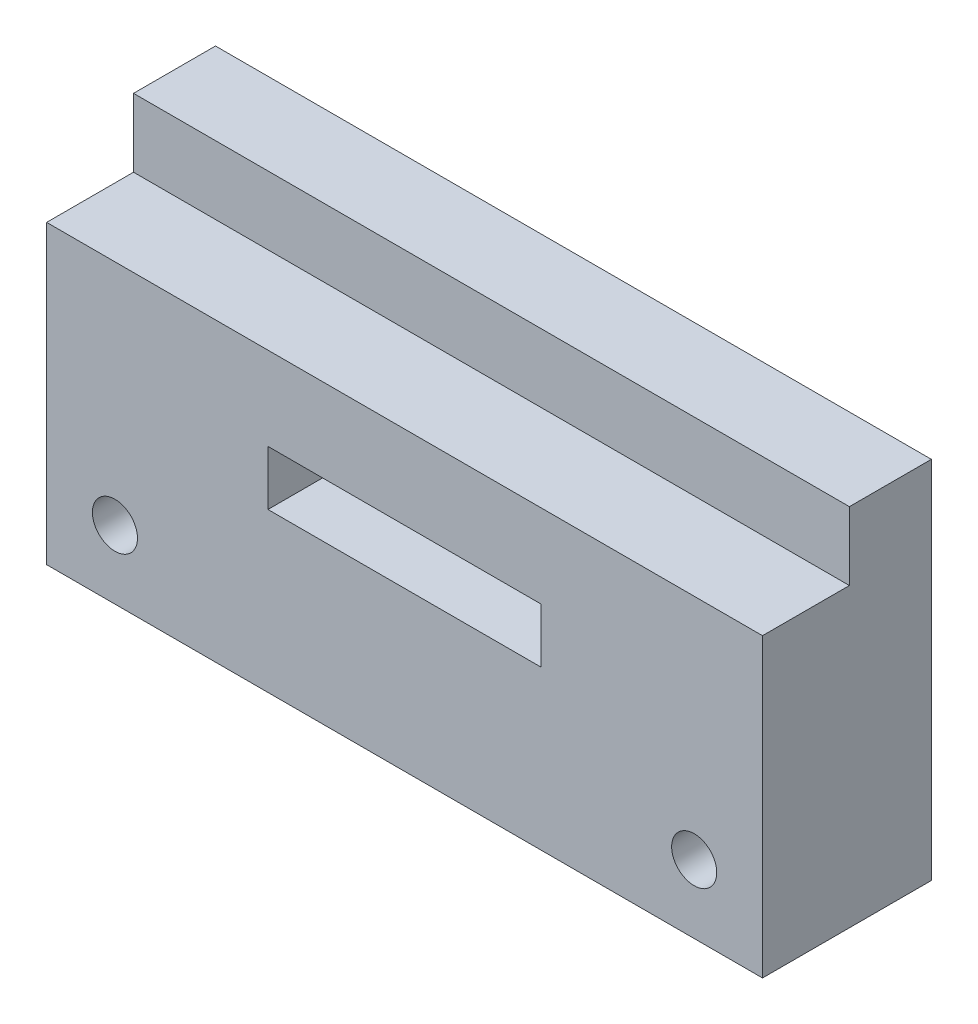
ISO-10303-21;
HEADER;
FILE_DESCRIPTION(('STEP AP214'),'2;1');
FILE_NAME('part.step','',(''),(''),'','','');
FILE_SCHEMA(('AUTOMOTIVE_DESIGN { 1 0 10303 214 1 1 1 1 }'));
ENDSEC;
DATA;
#1=APPLICATION_CONTEXT('core data for automotive mechanical design processes');
#2=APPLICATION_PROTOCOL_DEFINITION('international standard','automotive_design',2000,#1);
#3=PRODUCT_CONTEXT('',#1,'mechanical');
#4=PRODUCT('Part','Part','',(#3));
#5=PRODUCT_RELATED_PRODUCT_CATEGORY('part','',(#4));
#6=PRODUCT_DEFINITION_FORMATION('','',#4);
#7=PRODUCT_DEFINITION_CONTEXT('part definition',#1,'design');
#8=PRODUCT_DEFINITION('design','',#6,#7);
#9=PRODUCT_DEFINITION_SHAPE('','',#8);
#10=(LENGTH_UNIT() NAMED_UNIT(*) SI_UNIT(.MILLI.,.METRE.));
#11=(NAMED_UNIT(*) PLANE_ANGLE_UNIT() SI_UNIT($,.RADIAN.));
#12=(NAMED_UNIT(*) SI_UNIT($,.STERADIAN.) SOLID_ANGLE_UNIT());
#13=UNCERTAINTY_MEASURE_WITH_UNIT(LENGTH_MEASURE(1.E-05),#10,'distance_accuracy_value','');
#14=(GEOMETRIC_REPRESENTATION_CONTEXT(3) GLOBAL_UNCERTAINTY_ASSIGNED_CONTEXT((#13)) GLOBAL_UNIT_ASSIGNED_CONTEXT((#10,
#11,#12)) REPRESENTATION_CONTEXT('',''));
#15=CARTESIAN_POINT('',(0.,0.,0.));
#16=DIRECTION('',(0.,0.,1.));
#17=DIRECTION('',(1.,0.,0.));
#18=AXIS2_PLACEMENT_3D('',#15,#16,#17);
#19=CARTESIAN_POINT('',(52.4000000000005,0.,12.36));
#20=DIRECTION('',(0.,0.,1.));
#21=DIRECTION('',(1.,0.,0.));
#22=AXIS2_PLACEMENT_3D('',#19,#20,#21);
#23=PLANE('',#22);
#24=CARTESIAN_POINT('',(47.4000000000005,5.00000000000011,12.36));
#25=DIRECTION('',(0.,0.,1.));
#26=DIRECTION('',(1.,0.,0.));
#27=AXIS2_PLACEMENT_3D('',#24,#25,#26);
#28=CIRCLE('',#27,1.64999999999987);
#29=CARTESIAN_POINT('',(49.0500000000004,5.00000000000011,12.36));
#30=VERTEX_POINT('',#29);
#31=EDGE_CURVE('E137',#30,#30,#28,.T.);
#32=ORIENTED_EDGE('',*,*,#31,.F.);
#33=EDGE_LOOP('',(#32));
#34=FACE_BOUND('',#33,.T.);
#35=DIRECTION('',(-2.27248775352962E-13,1.,0.));
#36=VECTOR('',#35,1.);
#37=CARTESIAN_POINT('',(36.2000000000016,11.6000000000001,12.36));
#38=LINE('',#37,#36);
#39=CARTESIAN_POINT('',(36.2000000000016,11.6000000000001,12.36));
#40=VERTEX_POINT('',#39);
#41=CARTESIAN_POINT('',(36.2000000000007,15.6000000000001,12.36));
#42=VERTEX_POINT('',#41);
#43=EDGE_CURVE('E151',#40,#42,#38,.T.);
#44=ORIENTED_EDGE('',*,*,#43,.F.);
#45=DIRECTION('',(1.,0.,0.));
#46=VECTOR('',#45,1.);
#47=CARTESIAN_POINT('',(16.2000000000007,11.6000000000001,12.36));
#48=LINE('',#47,#46);
#49=CARTESIAN_POINT('',(16.2000000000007,11.6000000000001,12.36));
#50=VERTEX_POINT('',#49);
#51=EDGE_CURVE('E149',#50,#40,#48,.T.);
#52=ORIENTED_EDGE('',*,*,#51,.F.);
#53=DIRECTION('',(0.,-1.,0.));
#54=VECTOR('',#53,1.);
#55=CARTESIAN_POINT('',(16.2000000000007,11.6000000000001,12.36));
#56=LINE('',#55,#54);
#57=CARTESIAN_POINT('',(16.2000000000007,15.6000000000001,12.36));
#58=VERTEX_POINT('',#57);
#59=EDGE_CURVE('E156',#58,#50,#56,.T.);
#60=ORIENTED_EDGE('',*,*,#59,.F.);
#61=DIRECTION('',(-1.,0.,0.));
#62=VECTOR('',#61,1.);
#63=CARTESIAN_POINT('',(16.2000000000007,15.6000000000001,12.36));
#64=LINE('',#63,#62);
#65=EDGE_CURVE('E154',#42,#58,#64,.T.);
#66=ORIENTED_EDGE('',*,*,#65,.F.);
#67=EDGE_LOOP('',(#44,#52,#60,#66));
#68=FACE_BOUND('',#67,.T.);
#69=CARTESIAN_POINT('',(5.,5.,12.36));
#70=DIRECTION('',(0.,0.,1.));
#71=DIRECTION('',(1.,0.,0.));
#72=AXIS2_PLACEMENT_3D('',#69,#70,#71);
#73=CIRCLE('',#72,1.64999999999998);
#74=CARTESIAN_POINT('',(6.64999999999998,5.,12.36));
#75=VERTEX_POINT('',#74);
#76=EDGE_CURVE('E143',#75,#75,#73,.T.);
#77=ORIENTED_EDGE('',*,*,#76,.F.);
#78=EDGE_LOOP('',(#77));
#79=FACE_BOUND('',#78,.T.);
#80=DIRECTION('',(0.,1.,0.));
#81=VECTOR('',#80,1.);
#82=CARTESIAN_POINT('',(52.4000000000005,0.,12.36));
#83=LINE('',#82,#81);
#84=CARTESIAN_POINT('',(52.4000000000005,0.,12.36));
#85=VERTEX_POINT('',#84);
#86=CARTESIAN_POINT('',(52.4000000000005,21.6999999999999,12.3599999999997));
#87=VERTEX_POINT('',#86);
#88=EDGE_CURVE('E181',#85,#87,#83,.T.);
#89=ORIENTED_EDGE('',*,*,#88,.T.);
#90=DIRECTION('',(1.,0.,0.));
#91=VECTOR('',#90,1.);
#92=CARTESIAN_POINT('',(0.,21.6999999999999,12.3599999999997));
#93=LINE('',#92,#91);
#94=CARTESIAN_POINT('',(0.,21.6999999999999,12.3599999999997));
#95=VERTEX_POINT('',#94);
#96=EDGE_CURVE('E118',#95,#87,#93,.T.);
#97=ORIENTED_EDGE('',*,*,#96,.F.);
#98=DIRECTION('',(0.,-1.,0.));
#99=VECTOR('',#98,1.);
#100=CARTESIAN_POINT('',(0.,0.,12.36));
#101=LINE('',#100,#99);
#102=CARTESIAN_POINT('',(0.,0.,12.36));
#103=VERTEX_POINT('',#102);
#104=EDGE_CURVE('E128',#95,#103,#101,.T.);
#105=ORIENTED_EDGE('',*,*,#104,.T.);
#106=DIRECTION('',(1.,0.,0.));
#107=VECTOR('',#106,1.);
#108=CARTESIAN_POINT('',(0.,0.,12.36));
#109=LINE('',#108,#107);
#110=EDGE_CURVE('E178',#103,#85,#109,.T.);
#111=ORIENTED_EDGE('',*,*,#110,.T.);
#112=EDGE_LOOP('',(#89,#97,#105,#111));
#113=FACE_BOUND('',#112,.T.);
#114=ADVANCED_FACE('F33',(#34,#68,#79,#113),#23,.T.);
#115=CARTESIAN_POINT('',(52.4000000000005,0.,12.36));
#116=DIRECTION('',(-1.,0.,0.));
#117=DIRECTION('',(0.,0.,1.));
#118=AXIS2_PLACEMENT_3D('',#115,#116,#117);
#119=PLANE('',#118);
#120=DIRECTION('',(0.,0.,1.));
#121=VECTOR('',#120,1.);
#122=CARTESIAN_POINT('',(52.4000000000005,21.6999999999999,12.3599999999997));
#123=LINE('',#122,#121);
#124=CARTESIAN_POINT('',(52.4000000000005,21.6999999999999,6.00000000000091));
#125=VERTEX_POINT('',#124);
#126=EDGE_CURVE('E116',#125,#87,#123,.T.);
#127=ORIENTED_EDGE('',*,*,#126,.T.);
#128=ORIENTED_EDGE('',*,*,#88,.F.);
#129=DIRECTION('',(0.,0.,-1.));
#130=VECTOR('',#129,1.);
#131=CARTESIAN_POINT('',(52.4000000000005,0.,12.36));
#132=LINE('',#131,#130);
#133=CARTESIAN_POINT('',(52.4000000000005,0.,0.));
#134=VERTEX_POINT('',#133);
#135=EDGE_CURVE('E12',#85,#134,#132,.T.);
#136=ORIENTED_EDGE('',*,*,#135,.T.);
#137=DIRECTION('',(0.,1.,0.));
#138=VECTOR('',#137,1.);
#139=CARTESIAN_POINT('',(52.4000000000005,0.,0.));
#140=LINE('',#139,#138);
#141=CARTESIAN_POINT('',(52.4000000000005,26.7,0.));
#142=VERTEX_POINT('',#141);
#143=EDGE_CURVE('E189',#134,#142,#140,.T.);
#144=ORIENTED_EDGE('',*,*,#143,.T.);
#145=DIRECTION('',(0.,0.,-1.));
#146=VECTOR('',#145,1.);
#147=CARTESIAN_POINT('',(52.4000000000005,26.7,12.36));
#148=LINE('',#147,#146);
#149=CARTESIAN_POINT('',(52.4000000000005,26.6999999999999,6.00000000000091));
#150=VERTEX_POINT('',#149);
#151=EDGE_CURVE('E41',#150,#142,#148,.T.);
#152=ORIENTED_EDGE('',*,*,#151,.F.);
#153=DIRECTION('',(0.,-1.,0.));
#154=VECTOR('',#153,1.);
#155=CARTESIAN_POINT('',(52.4000000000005,21.6999999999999,6.00000000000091));
#156=LINE('',#155,#154);
#157=EDGE_CURVE('E132',#150,#125,#156,.T.);
#158=ORIENTED_EDGE('',*,*,#157,.T.);
#159=EDGE_LOOP('',(#127,#128,#136,#144,#152,#158));
#160=FACE_BOUND('',#159,.T.);
#161=ADVANCED_FACE('F205',(#160),#119,.F.);
#162=CARTESIAN_POINT('',(0.,26.7,12.36));
#163=DIRECTION('',(0.,-1.,0.));
#164=DIRECTION('',(0.,0.,-1.));
#165=AXIS2_PLACEMENT_3D('',#162,#163,#164);
#166=PLANE('',#165);
#167=DIRECTION('',(1.,0.,0.));
#168=VECTOR('',#167,1.);
#169=CARTESIAN_POINT('',(0.,26.6999999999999,6.00000000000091));
#170=LINE('',#169,#168);
#171=CARTESIAN_POINT('',(0.,26.7,6.00000000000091));
#172=VERTEX_POINT('',#171);
#173=EDGE_CURVE('E48',#172,#150,#170,.T.);
#174=ORIENTED_EDGE('',*,*,#173,.T.);
#175=ORIENTED_EDGE('',*,*,#151,.T.);
#176=DIRECTION('',(-1.,0.,0.));
#177=VECTOR('',#176,1.);
#178=CARTESIAN_POINT('',(0.,26.7,0.));
#179=LINE('',#178,#177);
#180=CARTESIAN_POINT('',(0.,26.7,0.));
#181=VERTEX_POINT('',#180);
#182=EDGE_CURVE('E192',#142,#181,#179,.T.);
#183=ORIENTED_EDGE('',*,*,#182,.T.);
#184=DIRECTION('',(0.,0.,-1.));
#185=VECTOR('',#184,1.);
#186=CARTESIAN_POINT('',(0.,26.7,12.36));
#187=LINE('',#186,#185);
#188=EDGE_CURVE('E198',#172,#181,#187,.T.);
#189=ORIENTED_EDGE('',*,*,#188,.F.);
#190=EDGE_LOOP('',(#174,#175,#183,#189));
#191=FACE_BOUND('',#190,.T.);
#192=ADVANCED_FACE('F201',(#191),#166,.F.);
#193=CARTESIAN_POINT('',(0.,0.,12.36));
#194=DIRECTION('',(1.,0.,0.));
#195=DIRECTION('',(0.,0.,-1.));
#196=AXIS2_PLACEMENT_3D('',#193,#194,#195);
#197=PLANE('',#196);
#198=DIRECTION('',(0.,0.,1.));
#199=VECTOR('',#198,1.);
#200=CARTESIAN_POINT('',(0.,21.6999999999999,12.3599999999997));
#201=LINE('',#200,#199);
#202=CARTESIAN_POINT('',(0.,21.6999999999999,6.00000000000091));
#203=VERTEX_POINT('',#202);
#204=EDGE_CURVE('E113',#203,#95,#201,.T.);
#205=ORIENTED_EDGE('',*,*,#204,.F.);
#206=DIRECTION('',(0.,-1.,0.));
#207=VECTOR('',#206,1.);
#208=CARTESIAN_POINT('',(0.,21.6999999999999,6.00000000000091));
#209=LINE('',#208,#207);
#210=EDGE_CURVE('E120',#172,#203,#209,.T.);
#211=ORIENTED_EDGE('',*,*,#210,.F.);
#212=ORIENTED_EDGE('',*,*,#188,.T.);
#213=DIRECTION('',(0.,-1.,0.));
#214=VECTOR('',#213,1.);
#215=CARTESIAN_POINT('',(0.,0.,0.));
#216=LINE('',#215,#214);
#217=CARTESIAN_POINT('',(0.,0.,0.));
#218=VERTEX_POINT('',#217);
#219=EDGE_CURVE('E182',#181,#218,#216,.T.);
#220=ORIENTED_EDGE('',*,*,#219,.T.);
#221=DIRECTION('',(0.,0.,-1.));
#222=VECTOR('',#221,1.);
#223=CARTESIAN_POINT('',(0.,0.,12.36));
#224=LINE('',#223,#222);
#225=EDGE_CURVE('E186',#103,#218,#224,.T.);
#226=ORIENTED_EDGE('',*,*,#225,.F.);
#227=ORIENTED_EDGE('',*,*,#104,.F.);
#228=EDGE_LOOP('',(#205,#211,#212,#220,#226,#227));
#229=FACE_BOUND('',#228,.T.);
#230=ADVANCED_FACE('F126',(#229),#197,.F.);
#231=CARTESIAN_POINT('',(52.4000000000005,0.,0.));
#232=DIRECTION('',(0.,0.,1.));
#233=DIRECTION('',(1.,0.,0.));
#234=AXIS2_PLACEMENT_3D('',#231,#232,#233);
#235=PLANE('',#234);
#236=CARTESIAN_POINT('',(5.,5.,0.));
#237=DIRECTION('',(0.,0.,1.));
#238=DIRECTION('',(1.,0.,0.));
#239=AXIS2_PLACEMENT_3D('',#236,#237,#238);
#240=CIRCLE('',#239,1.64999999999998);
#241=CARTESIAN_POINT('',(6.64999999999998,5.,0.));
#242=VERTEX_POINT('',#241);
#243=EDGE_CURVE('E140',#242,#242,#240,.T.);
#244=ORIENTED_EDGE('',*,*,#243,.T.);
#245=EDGE_LOOP('',(#244));
#246=FACE_BOUND('',#245,.T.);
#247=DIRECTION('',(1.,0.,0.));
#248=VECTOR('',#247,1.);
#249=CARTESIAN_POINT('',(0.,0.,0.));
#250=LINE('',#249,#248);
#251=EDGE_CURVE('E177',#218,#134,#250,.T.);
#252=ORIENTED_EDGE('',*,*,#251,.F.);
#253=ORIENTED_EDGE('',*,*,#219,.F.);
#254=ORIENTED_EDGE('',*,*,#182,.F.);
#255=ORIENTED_EDGE('',*,*,#143,.F.);
#256=EDGE_LOOP('',(#252,#253,#254,#255));
#257=FACE_BOUND('',#256,.T.);
#258=DIRECTION('',(1.,0.,0.));
#259=VECTOR('',#258,1.);
#260=CARTESIAN_POINT('',(16.2000000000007,11.6000000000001,0.));
#261=LINE('',#260,#259);
#262=CARTESIAN_POINT('',(16.2000000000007,11.6000000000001,0.));
#263=VERTEX_POINT('',#262);
#264=CARTESIAN_POINT('',(36.2000000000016,11.6000000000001,0.));
#265=VERTEX_POINT('',#264);
#266=EDGE_CURVE('E146',#263,#265,#261,.T.);
#267=ORIENTED_EDGE('',*,*,#266,.T.);
#268=DIRECTION('',(-2.27248775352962E-13,1.,0.));
#269=VECTOR('',#268,1.);
#270=CARTESIAN_POINT('',(36.2000000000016,11.6000000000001,0.));
#271=LINE('',#270,#269);
#272=CARTESIAN_POINT('',(36.2000000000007,15.6000000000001,0.));
#273=VERTEX_POINT('',#272);
#274=EDGE_CURVE('E161',#265,#273,#271,.T.);
#275=ORIENTED_EDGE('',*,*,#274,.T.);
#276=DIRECTION('',(-1.,0.,0.));
#277=VECTOR('',#276,1.);
#278=CARTESIAN_POINT('',(16.2000000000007,15.6000000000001,0.));
#279=LINE('',#278,#277);
#280=CARTESIAN_POINT('',(16.2000000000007,15.6000000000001,0.));
#281=VERTEX_POINT('',#280);
#282=EDGE_CURVE('E164',#273,#281,#279,.T.);
#283=ORIENTED_EDGE('',*,*,#282,.T.);
#284=DIRECTION('',(0.,-1.,0.));
#285=VECTOR('',#284,1.);
#286=CARTESIAN_POINT('',(16.2000000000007,11.6000000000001,0.));
#287=LINE('',#286,#285);
#288=EDGE_CURVE('E152',#281,#263,#287,.T.);
#289=ORIENTED_EDGE('',*,*,#288,.T.);
#290=EDGE_LOOP('',(#267,#275,#283,#289));
#291=FACE_BOUND('',#290,.T.);
#292=CARTESIAN_POINT('',(47.4000000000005,5.00000000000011,0.));
#293=DIRECTION('',(0.,0.,1.));
#294=DIRECTION('',(1.,0.,0.));
#295=AXIS2_PLACEMENT_3D('',#292,#293,#294);
#296=CIRCLE('',#295,1.64999999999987);
#297=CARTESIAN_POINT('',(49.0500000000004,5.00000000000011,0.));
#298=VERTEX_POINT('',#297);
#299=EDGE_CURVE('E135',#298,#298,#296,.T.);
#300=ORIENTED_EDGE('',*,*,#299,.T.);
#301=EDGE_LOOP('',(#300));
#302=FACE_BOUND('',#301,.T.);
#303=ADVANCED_FACE('F209',(#246,#257,#291,#302),#235,.F.);
#304=CARTESIAN_POINT('',(0.,0.,12.36));
#305=DIRECTION('',(0.,1.,0.));
#306=DIRECTION('',(0.,0.,1.));
#307=AXIS2_PLACEMENT_3D('',#304,#305,#306);
#308=PLANE('',#307);
#309=ORIENTED_EDGE('',*,*,#251,.T.);
#310=ORIENTED_EDGE('',*,*,#135,.F.);
#311=ORIENTED_EDGE('',*,*,#110,.F.);
#312=ORIENTED_EDGE('',*,*,#225,.T.);
#313=EDGE_LOOP('',(#309,#310,#311,#312));
#314=FACE_BOUND('',#313,.T.);
#315=ADVANCED_FACE('F35',(#314),#308,.F.);
#316=CARTESIAN_POINT('',(16.2000000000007,11.6000000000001,12.36));
#317=DIRECTION('',(0.,1.,0.));
#318=DIRECTION('',(0.,0.,1.));
#319=AXIS2_PLACEMENT_3D('',#316,#317,#318);
#320=PLANE('',#319);
#321=ORIENTED_EDGE('',*,*,#266,.F.);
#322=DIRECTION('',(0.,0.,-1.));
#323=VECTOR('',#322,1.);
#324=CARTESIAN_POINT('',(16.2000000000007,11.6000000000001,12.36));
#325=LINE('',#324,#323);
#326=EDGE_CURVE('E158',#50,#263,#325,.T.);
#327=ORIENTED_EDGE('',*,*,#326,.F.);
#328=ORIENTED_EDGE('',*,*,#51,.T.);
#329=DIRECTION('',(0.,0.,-1.));
#330=VECTOR('',#329,1.);
#331=CARTESIAN_POINT('',(36.2000000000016,11.6000000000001,12.36));
#332=LINE('',#331,#330);
#333=EDGE_CURVE('E174',#40,#265,#332,.T.);
#334=ORIENTED_EDGE('',*,*,#333,.T.);
#335=EDGE_LOOP('',(#321,#327,#328,#334));
#336=FACE_BOUND('',#335,.T.);
#337=ADVANCED_FACE('F224',(#336),#320,.T.);
#338=CARTESIAN_POINT('',(36.2000000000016,11.6000000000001,12.36));
#339=DIRECTION('',(-1.,-2.27248775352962E-13,0.));
#340=DIRECTION('',(2.27248775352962E-13,-1.,0.));
#341=AXIS2_PLACEMENT_3D('',#338,#339,#340);
#342=PLANE('',#341);
#343=ORIENTED_EDGE('',*,*,#274,.F.);
#344=ORIENTED_EDGE('',*,*,#333,.F.);
#345=ORIENTED_EDGE('',*,*,#43,.T.);
#346=DIRECTION('',(0.,0.,-1.));
#347=VECTOR('',#346,1.);
#348=CARTESIAN_POINT('',(36.2000000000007,15.6000000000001,12.36));
#349=LINE('',#348,#347);
#350=EDGE_CURVE('E172',#42,#273,#349,.T.);
#351=ORIENTED_EDGE('',*,*,#350,.T.);
#352=EDGE_LOOP('',(#343,#344,#345,#351));
#353=FACE_BOUND('',#352,.T.);
#354=ADVANCED_FACE('F256',(#353),#342,.T.);
#355=CARTESIAN_POINT('',(16.2000000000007,15.6000000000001,12.36));
#356=DIRECTION('',(0.,-1.,0.));
#357=DIRECTION('',(0.,0.,-1.));
#358=AXIS2_PLACEMENT_3D('',#355,#356,#357);
#359=PLANE('',#358);
#360=ORIENTED_EDGE('',*,*,#282,.F.);
#361=ORIENTED_EDGE('',*,*,#350,.F.);
#362=ORIENTED_EDGE('',*,*,#65,.T.);
#363=DIRECTION('',(0.,0.,-1.));
#364=VECTOR('',#363,1.);
#365=CARTESIAN_POINT('',(16.2000000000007,15.6000000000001,12.36));
#366=LINE('',#365,#364);
#367=EDGE_CURVE('E56',#58,#281,#366,.T.);
#368=ORIENTED_EDGE('',*,*,#367,.T.);
#369=EDGE_LOOP('',(#360,#361,#362,#368));
#370=FACE_BOUND('',#369,.T.);
#371=ADVANCED_FACE('F263',(#370),#359,.T.);
#372=CARTESIAN_POINT('',(16.2000000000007,11.6000000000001,12.36));
#373=DIRECTION('',(1.,0.,0.));
#374=DIRECTION('',(0.,0.,-1.));
#375=AXIS2_PLACEMENT_3D('',#372,#373,#374);
#376=PLANE('',#375);
#377=ORIENTED_EDGE('',*,*,#288,.F.);
#378=ORIENTED_EDGE('',*,*,#367,.F.);
#379=ORIENTED_EDGE('',*,*,#59,.T.);
#380=ORIENTED_EDGE('',*,*,#326,.T.);
#381=EDGE_LOOP('',(#377,#378,#379,#380));
#382=FACE_BOUND('',#381,.T.);
#383=ADVANCED_FACE('F270',(#382),#376,.T.);
#384=CARTESIAN_POINT('',(5.,5.,12.36));
#385=DIRECTION('',(0.,0.,-1.));
#386=DIRECTION('',(-1.,0.,0.));
#387=AXIS2_PLACEMENT_3D('',#384,#385,#386);
#388=CYLINDRICAL_SURFACE('',#387,1.64999999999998);
#389=ORIENTED_EDGE('',*,*,#76,.T.);
#390=EDGE_LOOP('',(#389));
#391=FACE_BOUND('',#390,.T.);
#392=ORIENTED_EDGE('',*,*,#243,.F.);
#393=EDGE_LOOP('',(#392));
#394=FACE_BOUND('',#393,.T.);
#395=ADVANCED_FACE('F278',(#391,#394),#388,.F.);
#396=CARTESIAN_POINT('',(47.4000000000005,5.00000000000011,12.36));
#397=DIRECTION('',(0.,0.,-1.));
#398=DIRECTION('',(-1.,0.,0.));
#399=AXIS2_PLACEMENT_3D('',#396,#397,#398);
#400=CYLINDRICAL_SURFACE('',#399,1.64999999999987);
#401=ORIENTED_EDGE('',*,*,#31,.T.);
#402=EDGE_LOOP('',(#401));
#403=FACE_BOUND('',#402,.T.);
#404=ORIENTED_EDGE('',*,*,#299,.F.);
#405=EDGE_LOOP('',(#404));
#406=FACE_BOUND('',#405,.T.);
#407=ADVANCED_FACE('F285',(#403,#406),#400,.F.);
#408=CARTESIAN_POINT('',(0.,21.6999999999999,12.3599999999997));
#409=DIRECTION('',(0.,1.,0.));
#410=DIRECTION('',(0.,0.,1.));
#411=AXIS2_PLACEMENT_3D('',#408,#409,#410);
#412=PLANE('',#411);
#413=ORIENTED_EDGE('',*,*,#126,.F.);
#414=DIRECTION('',(1.,0.,0.));
#415=VECTOR('',#414,1.);
#416=CARTESIAN_POINT('',(0.,21.6999999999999,6.00000000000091));
#417=LINE('',#416,#415);
#418=EDGE_CURVE('E110',#203,#125,#417,.T.);
#419=ORIENTED_EDGE('',*,*,#418,.F.);
#420=ORIENTED_EDGE('',*,*,#204,.T.);
#421=ORIENTED_EDGE('',*,*,#96,.T.);
#422=EDGE_LOOP('',(#413,#419,#420,#421));
#423=FACE_BOUND('',#422,.T.);
#424=ADVANCED_FACE('F111',(#423),#412,.T.);
#425=CARTESIAN_POINT('',(0.,21.6999999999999,6.00000000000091));
#426=DIRECTION('',(0.,0.,1.));
#427=DIRECTION('',(1.,0.,0.));
#428=AXIS2_PLACEMENT_3D('',#425,#426,#427);
#429=PLANE('',#428);
#430=ORIENTED_EDGE('',*,*,#157,.F.);
#431=ORIENTED_EDGE('',*,*,#173,.F.);
#432=ORIENTED_EDGE('',*,*,#210,.T.);
#433=ORIENTED_EDGE('',*,*,#418,.T.);
#434=EDGE_LOOP('',(#430,#431,#432,#433));
#435=FACE_BOUND('',#434,.T.);
#436=ADVANCED_FACE('F121',(#435),#429,.T.);
#437=CLOSED_SHELL('',(#114,#161,#192,#230,#303,#315,#337,#354,#371,#383,#395,#407,#424,#436));
#438=MANIFOLD_SOLID_BREP('B2',#437);
#439=ADVANCED_BREP_SHAPE_REPRESENTATION('',(#18,#438),#14);
#440=SHAPE_DEFINITION_REPRESENTATION(#9,#439);
ENDSEC;
END-ISO-10303-21;
